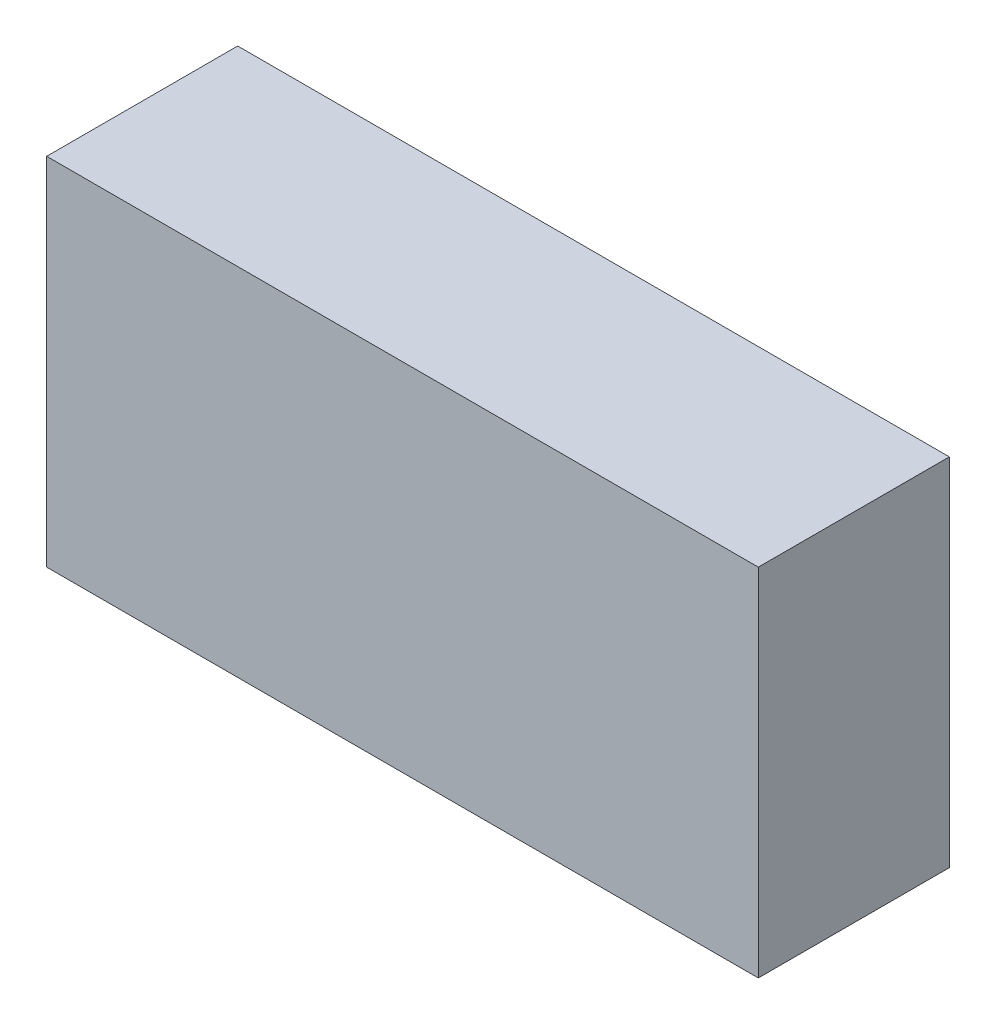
ISO-10303-21;
HEADER;
FILE_DESCRIPTION(('STEP AP214'),'2;1');
FILE_NAME('part.step','',(''),(''),'','','');
FILE_SCHEMA(('AUTOMOTIVE_DESIGN { 1 0 10303 214 1 1 1 1 }'));
ENDSEC;
DATA;
#1=APPLICATION_CONTEXT('core data for automotive mechanical design processes');
#2=APPLICATION_PROTOCOL_DEFINITION('international standard','automotive_design',2000,#1);
#3=PRODUCT_CONTEXT('',#1,'mechanical');
#4=PRODUCT('Part','Part','',(#3));
#5=PRODUCT_RELATED_PRODUCT_CATEGORY('part','',(#4));
#6=PRODUCT_DEFINITION_FORMATION('','',#4);
#7=PRODUCT_DEFINITION_CONTEXT('part definition',#1,'design');
#8=PRODUCT_DEFINITION('design','',#6,#7);
#9=PRODUCT_DEFINITION_SHAPE('','',#8);
#10=(LENGTH_UNIT() NAMED_UNIT(*) SI_UNIT(.MILLI.,.METRE.));
#11=(NAMED_UNIT(*) PLANE_ANGLE_UNIT() SI_UNIT($,.RADIAN.));
#12=(NAMED_UNIT(*) SI_UNIT($,.STERADIAN.) SOLID_ANGLE_UNIT());
#13=UNCERTAINTY_MEASURE_WITH_UNIT(LENGTH_MEASURE(1.E-05),#10,'distance_accuracy_value','');
#14=(GEOMETRIC_REPRESENTATION_CONTEXT(3) GLOBAL_UNCERTAINTY_ASSIGNED_CONTEXT((#13)) GLOBAL_UNIT_ASSIGNED_CONTEXT((#10,
#11,#12)) REPRESENTATION_CONTEXT('',''));
#15=CARTESIAN_POINT('',(0.,0.,0.));
#16=DIRECTION('',(0.,0.,1.));
#17=DIRECTION('',(1.,0.,0.));
#18=AXIS2_PLACEMENT_3D('',#15,#16,#17);
#19=CARTESIAN_POINT('',(-0.5588,-0.2794,0.3));
#20=DIRECTION('',(1.,0.,0.));
#21=DIRECTION('',(0.,0.,-1.));
#22=AXIS2_PLACEMENT_3D('',#19,#20,#21);
#23=PLANE('',#22);
#24=DIRECTION('',(0.,-1.,0.));
#25=VECTOR('',#24,1.);
#26=CARTESIAN_POINT('',(-0.5588,-0.2794,0.));
#27=LINE('',#26,#25);
#28=CARTESIAN_POINT('',(-0.5588,0.2794,0.));
#29=VERTEX_POINT('',#28);
#30=CARTESIAN_POINT('',(-0.5588,-0.2794,0.));
#31=VERTEX_POINT('',#30);
#32=EDGE_CURVE('E95',#29,#31,#27,.T.);
#33=ORIENTED_EDGE('',*,*,#32,.T.);
#34=DIRECTION('',(0.,0.,-1.));
#35=VECTOR('',#34,1.);
#36=CARTESIAN_POINT('',(-0.5588,-0.2794,0.3));
#37=LINE('',#36,#35);
#38=CARTESIAN_POINT('',(-0.5588,-0.2794,0.3));
#39=VERTEX_POINT('',#38);
#40=EDGE_CURVE('E11',#39,#31,#37,.T.);
#41=ORIENTED_EDGE('',*,*,#40,.F.);
#42=DIRECTION('',(0.,-1.,0.));
#43=VECTOR('',#42,1.);
#44=CARTESIAN_POINT('',(-0.5588,-0.2794,0.3));
#45=LINE('',#44,#43);
#46=CARTESIAN_POINT('',(-0.5588,0.2794,0.3));
#47=VERTEX_POINT('',#46);
#48=EDGE_CURVE('E83',#47,#39,#45,.T.);
#49=ORIENTED_EDGE('',*,*,#48,.F.);
#50=DIRECTION('',(0.,0.,-1.));
#51=VECTOR('',#50,1.);
#52=CARTESIAN_POINT('',(-0.5588,0.2794,0.3));
#53=LINE('',#52,#51);
#54=EDGE_CURVE('E91',#47,#29,#53,.T.);
#55=ORIENTED_EDGE('',*,*,#54,.T.);
#56=EDGE_LOOP('',(#33,#41,#49,#55));
#57=FACE_BOUND('',#56,.T.);
#58=ADVANCED_FACE('F32',(#57),#23,.F.);
#59=CARTESIAN_POINT('',(0.5588,-0.2794,0.3));
#60=DIRECTION('',(0.,1.,0.));
#61=DIRECTION('',(0.,0.,1.));
#62=AXIS2_PLACEMENT_3D('',#59,#60,#61);
#63=PLANE('',#62);
#64=DIRECTION('',(1.,0.,0.));
#65=VECTOR('',#64,1.);
#66=CARTESIAN_POINT('',(0.5588,-0.2794,0.));
#67=LINE('',#66,#65);
#68=CARTESIAN_POINT('',(0.5588,-0.2794,0.));
#69=VERTEX_POINT('',#68);
#70=EDGE_CURVE('E87',#31,#69,#67,.T.);
#71=ORIENTED_EDGE('',*,*,#70,.T.);
#72=DIRECTION('',(0.,0.,-1.));
#73=VECTOR('',#72,1.);
#74=CARTESIAN_POINT('',(0.5588,-0.2794,0.3));
#75=LINE('',#74,#73);
#76=CARTESIAN_POINT('',(0.5588,-0.2794,0.3));
#77=VERTEX_POINT('',#76);
#78=EDGE_CURVE('E40',#77,#69,#75,.T.);
#79=ORIENTED_EDGE('',*,*,#78,.F.);
#80=DIRECTION('',(1.,0.,0.));
#81=VECTOR('',#80,1.);
#82=CARTESIAN_POINT('',(0.5588,-0.2794,0.3));
#83=LINE('',#82,#81);
#84=EDGE_CURVE('E78',#39,#77,#83,.T.);
#85=ORIENTED_EDGE('',*,*,#84,.F.);
#86=ORIENTED_EDGE('',*,*,#40,.T.);
#87=EDGE_LOOP('',(#71,#79,#85,#86));
#88=FACE_BOUND('',#87,.T.);
#89=ADVANCED_FACE('F86',(#88),#63,.F.);
#90=CARTESIAN_POINT('',(0.5588,0.2794,0.3));
#91=DIRECTION('',(-1.,0.,0.));
#92=DIRECTION('',(0.,0.,1.));
#93=AXIS2_PLACEMENT_3D('',#90,#91,#92);
#94=PLANE('',#93);
#95=DIRECTION('',(0.,1.,0.));
#96=VECTOR('',#95,1.);
#97=CARTESIAN_POINT('',(0.5588,0.2794,0.));
#98=LINE('',#97,#96);
#99=CARTESIAN_POINT('',(0.5588,0.2794,0.));
#100=VERTEX_POINT('',#99);
#101=EDGE_CURVE('E65',#69,#100,#98,.T.);
#102=ORIENTED_EDGE('',*,*,#101,.T.);
#103=DIRECTION('',(0.,0.,-1.));
#104=VECTOR('',#103,1.);
#105=CARTESIAN_POINT('',(0.5588,0.2794,0.3));
#106=LINE('',#105,#104);
#107=CARTESIAN_POINT('',(0.5588,0.2794,0.3));
#108=VERTEX_POINT('',#107);
#109=EDGE_CURVE('E88',#108,#100,#106,.T.);
#110=ORIENTED_EDGE('',*,*,#109,.F.);
#111=DIRECTION('',(0.,1.,0.));
#112=VECTOR('',#111,1.);
#113=CARTESIAN_POINT('',(0.5588,0.2794,0.3));
#114=LINE('',#113,#112);
#115=EDGE_CURVE('E81',#77,#108,#114,.T.);
#116=ORIENTED_EDGE('',*,*,#115,.F.);
#117=ORIENTED_EDGE('',*,*,#78,.T.);
#118=EDGE_LOOP('',(#102,#110,#116,#117));
#119=FACE_BOUND('',#118,.T.);
#120=ADVANCED_FACE('F89',(#119),#94,.F.);
#121=CARTESIAN_POINT('',(-0.5588,0.2794,0.3));
#122=DIRECTION('',(0.,-1.,0.));
#123=DIRECTION('',(0.,0.,-1.));
#124=AXIS2_PLACEMENT_3D('',#121,#122,#123);
#125=PLANE('',#124);
#126=DIRECTION('',(-1.,0.,0.));
#127=VECTOR('',#126,1.);
#128=CARTESIAN_POINT('',(-0.5588,0.2794,0.));
#129=LINE('',#128,#127);
#130=EDGE_CURVE('E71',#100,#29,#129,.T.);
#131=ORIENTED_EDGE('',*,*,#130,.T.);
#132=ORIENTED_EDGE('',*,*,#54,.F.);
#133=DIRECTION('',(-1.,0.,0.));
#134=VECTOR('',#133,1.);
#135=CARTESIAN_POINT('',(-0.5588,0.2794,0.3));
#136=LINE('',#135,#134);
#137=EDGE_CURVE('E48',#108,#47,#136,.T.);
#138=ORIENTED_EDGE('',*,*,#137,.F.);
#139=ORIENTED_EDGE('',*,*,#109,.T.);
#140=EDGE_LOOP('',(#131,#132,#138,#139));
#141=FACE_BOUND('',#140,.T.);
#142=ADVANCED_FACE('F102',(#141),#125,.F.);
#143=CARTESIAN_POINT('',(0.,0.,0.3));
#144=DIRECTION('',(0.,0.,-1.));
#145=DIRECTION('',(-1.,0.,0.));
#146=AXIS2_PLACEMENT_3D('',#143,#144,#145);
#147=PLANE('',#146);
#148=ORIENTED_EDGE('',*,*,#48,.T.);
#149=ORIENTED_EDGE('',*,*,#84,.T.);
#150=ORIENTED_EDGE('',*,*,#115,.T.);
#151=ORIENTED_EDGE('',*,*,#137,.T.);
#152=EDGE_LOOP('',(#148,#149,#150,#151));
#153=FACE_BOUND('',#152,.T.);
#154=ADVANCED_FACE('F79',(#153),#147,.F.);
#155=CARTESIAN_POINT('',(0.,0.,0.));
#156=DIRECTION('',(0.,0.,-1.));
#157=DIRECTION('',(-1.,0.,0.));
#158=AXIS2_PLACEMENT_3D('',#155,#156,#157);
#159=PLANE('',#158);
#160=ORIENTED_EDGE('',*,*,#32,.F.);
#161=ORIENTED_EDGE('',*,*,#130,.F.);
#162=ORIENTED_EDGE('',*,*,#101,.F.);
#163=ORIENTED_EDGE('',*,*,#70,.F.);
#164=EDGE_LOOP('',(#160,#161,#162,#163));
#165=FACE_BOUND('',#164,.T.);
#166=ADVANCED_FACE('F105',(#165),#159,.T.);
#167=CLOSED_SHELL('',(#58,#89,#120,#142,#154,#166));
#168=MANIFOLD_SOLID_BREP('B2',#167);
#169=ADVANCED_BREP_SHAPE_REPRESENTATION('',(#18,#168),#14);
#170=SHAPE_DEFINITION_REPRESENTATION(#9,#169);
ENDSEC;
END-ISO-10303-21;
